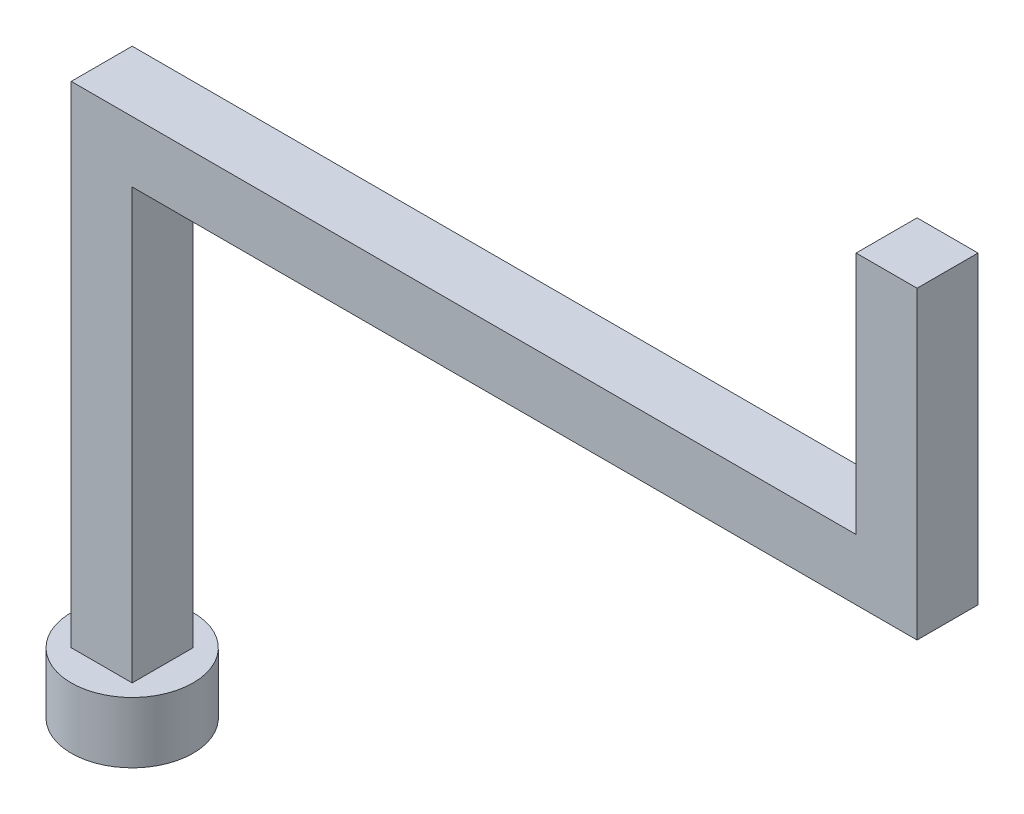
ISO-10303-21;
HEADER;
FILE_DESCRIPTION(('STEP AP214'),'2;1');
FILE_NAME('part.step','',(''),(''),'','','');
FILE_SCHEMA(('AUTOMOTIVE_DESIGN { 1 0 10303 214 1 1 1 1 }'));
ENDSEC;
DATA;
#1=APPLICATION_CONTEXT('core data for automotive mechanical design processes');
#2=APPLICATION_PROTOCOL_DEFINITION('international standard','automotive_design',2000,#1);
#3=PRODUCT_CONTEXT('',#1,'mechanical');
#4=PRODUCT('Part','Part','',(#3));
#5=PRODUCT_RELATED_PRODUCT_CATEGORY('part','',(#4));
#6=PRODUCT_DEFINITION_FORMATION('','',#4);
#7=PRODUCT_DEFINITION_CONTEXT('part definition',#1,'design');
#8=PRODUCT_DEFINITION('design','',#6,#7);
#9=PRODUCT_DEFINITION_SHAPE('','',#8);
#10=(LENGTH_UNIT() NAMED_UNIT(*) SI_UNIT(.MILLI.,.METRE.));
#11=(NAMED_UNIT(*) PLANE_ANGLE_UNIT() SI_UNIT($,.RADIAN.));
#12=(NAMED_UNIT(*) SI_UNIT($,.STERADIAN.) SOLID_ANGLE_UNIT());
#13=UNCERTAINTY_MEASURE_WITH_UNIT(LENGTH_MEASURE(1.E-05),#10,'distance_accuracy_value','');
#14=(GEOMETRIC_REPRESENTATION_CONTEXT(3) GLOBAL_UNCERTAINTY_ASSIGNED_CONTEXT((#13)) GLOBAL_UNIT_ASSIGNED_CONTEXT((#10,
#11,#12)) REPRESENTATION_CONTEXT('',''));
#15=CARTESIAN_POINT('',(0.,0.,0.));
#16=DIRECTION('',(0.,0.,1.));
#17=DIRECTION('',(1.,0.,0.));
#18=AXIS2_PLACEMENT_3D('',#15,#16,#17);
#19=CARTESIAN_POINT('',(0.,12.7,3.175));
#20=DIRECTION('',(-1.,0.,0.));
#21=DIRECTION('',(0.,0.,1.));
#22=AXIS2_PLACEMENT_3D('',#19,#20,#21);
#23=PLANE('',#22);
#24=DIRECTION('',(0.,1.,0.));
#25=VECTOR('',#24,1.);
#26=CARTESIAN_POINT('',(0.,12.7,0.));
#27=LINE('',#26,#25);
#28=CARTESIAN_POINT('',(0.,0.,0.));
#29=VERTEX_POINT('',#28);
#30=CARTESIAN_POINT('',(0.,22.377862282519,0.));
#31=VERTEX_POINT('',#30);
#32=EDGE_CURVE('E124',#29,#31,#27,.T.);
#33=ORIENTED_EDGE('',*,*,#32,.T.);
#34=DIRECTION('',(0.,0.,-1.));
#35=VECTOR('',#34,1.);
#36=CARTESIAN_POINT('',(0.,22.377862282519,3.175));
#37=LINE('',#36,#35);
#38=CARTESIAN_POINT('',(0.,22.377862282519,3.175));
#39=VERTEX_POINT('',#38);
#40=EDGE_CURVE('E11',#39,#31,#37,.T.);
#41=ORIENTED_EDGE('',*,*,#40,.F.);
#42=DIRECTION('',(0.,1.,0.));
#43=VECTOR('',#42,1.);
#44=CARTESIAN_POINT('',(0.,0.,3.175));
#45=LINE('',#44,#43);
#46=CARTESIAN_POINT('',(0.,0.,3.175));
#47=VERTEX_POINT('',#46);
#48=EDGE_CURVE('E85',#47,#39,#45,.T.);
#49=ORIENTED_EDGE('',*,*,#48,.F.);
#50=DIRECTION('',(0.,0.,-1.));
#51=VECTOR('',#50,1.);
#52=CARTESIAN_POINT('',(0.,0.,3.175));
#53=LINE('',#52,#51);
#54=EDGE_CURVE('E120',#47,#29,#53,.T.);
#55=ORIENTED_EDGE('',*,*,#54,.T.);
#56=EDGE_LOOP('',(#33,#41,#49,#55));
#57=FACE_BOUND('',#56,.T.);
#58=ADVANCED_FACE('F33',(#57),#23,.F.);
#59=CARTESIAN_POINT('',(40.8885604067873,22.377862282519,3.175));
#60=DIRECTION('',(0.,1.,0.));
#61=DIRECTION('',(-1.,0.,0.));
#62=AXIS2_PLACEMENT_3D('',#59,#60,#61);
#63=PLANE('',#62);
#64=DIRECTION('',(1.,0.,0.));
#65=VECTOR('',#64,1.);
#66=CARTESIAN_POINT('',(40.8885604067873,22.377862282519,0.));
#67=LINE('',#66,#65);
#68=CARTESIAN_POINT('',(40.8885604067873,22.377862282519,0.));
#69=VERTEX_POINT('',#68);
#70=EDGE_CURVE('E126',#31,#69,#67,.T.);
#71=ORIENTED_EDGE('',*,*,#70,.T.);
#72=DIRECTION('',(0.,0.,-1.));
#73=VECTOR('',#72,1.);
#74=CARTESIAN_POINT('',(40.8885604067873,22.377862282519,3.175));
#75=LINE('',#74,#73);
#76=CARTESIAN_POINT('',(40.8885604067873,22.377862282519,3.175));
#77=VERTEX_POINT('',#76);
#78=EDGE_CURVE('E41',#77,#69,#75,.T.);
#79=ORIENTED_EDGE('',*,*,#78,.F.);
#80=DIRECTION('',(1.,0.,0.));
#81=VECTOR('',#80,1.);
#82=CARTESIAN_POINT('',(40.8885604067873,22.377862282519,3.175));
#83=LINE('',#82,#81);
#84=EDGE_CURVE('E160',#39,#77,#83,.T.);
#85=ORIENTED_EDGE('',*,*,#84,.F.);
#86=ORIENTED_EDGE('',*,*,#40,.T.);
#87=EDGE_LOOP('',(#71,#79,#85,#86));
#88=FACE_BOUND('',#87,.T.);
#89=ADVANCED_FACE('F159',(#88),#63,.F.);
#90=CARTESIAN_POINT('',(40.8885604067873,38.252862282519,3.175));
#91=DIRECTION('',(-1.,0.,0.));
#92=DIRECTION('',(0.,0.,1.));
#93=AXIS2_PLACEMENT_3D('',#90,#91,#92);
#94=PLANE('',#93);
#95=DIRECTION('',(0.,1.,0.));
#96=VECTOR('',#95,1.);
#97=CARTESIAN_POINT('',(40.8885604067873,38.252862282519,0.));
#98=LINE('',#97,#96);
#99=CARTESIAN_POINT('',(40.8885604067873,38.252862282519,0.));
#100=VERTEX_POINT('',#99);
#101=EDGE_CURVE('E130',#69,#100,#98,.T.);
#102=ORIENTED_EDGE('',*,*,#101,.T.);
#103=DIRECTION('',(0.,0.,-1.));
#104=VECTOR('',#103,1.);
#105=CARTESIAN_POINT('',(40.8885604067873,38.252862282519,3.175));
#106=LINE('',#105,#104);
#107=CARTESIAN_POINT('',(40.8885604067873,38.252862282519,3.175));
#108=VERTEX_POINT('',#107);
#109=EDGE_CURVE('E148',#108,#100,#106,.T.);
#110=ORIENTED_EDGE('',*,*,#109,.F.);
#111=DIRECTION('',(0.,1.,0.));
#112=VECTOR('',#111,1.);
#113=CARTESIAN_POINT('',(40.8885604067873,25.552862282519,3.175));
#114=LINE('',#113,#112);
#115=EDGE_CURVE('E156',#77,#108,#114,.T.);
#116=ORIENTED_EDGE('',*,*,#115,.F.);
#117=ORIENTED_EDGE('',*,*,#78,.T.);
#118=EDGE_LOOP('',(#102,#110,#116,#117));
#119=FACE_BOUND('',#118,.T.);
#120=ADVANCED_FACE('F154',(#119),#94,.F.);
#121=CARTESIAN_POINT('',(37.7135604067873,38.252862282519,3.175));
#122=DIRECTION('',(0.,-1.,0.));
#123=DIRECTION('',(0.,0.,-1.));
#124=AXIS2_PLACEMENT_3D('',#121,#122,#123);
#125=PLANE('',#124);
#126=DIRECTION('',(-1.,0.,0.));
#127=VECTOR('',#126,1.);
#128=CARTESIAN_POINT('',(37.7135604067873,38.252862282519,0.));
#129=LINE('',#128,#127);
#130=CARTESIAN_POINT('',(37.7135604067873,38.252862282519,0.));
#131=VERTEX_POINT('',#130);
#132=EDGE_CURVE('E132',#100,#131,#129,.T.);
#133=ORIENTED_EDGE('',*,*,#132,.T.);
#134=DIRECTION('',(0.,0.,-1.));
#135=VECTOR('',#134,1.);
#136=CARTESIAN_POINT('',(37.7135604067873,38.252862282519,3.175));
#137=LINE('',#136,#135);
#138=CARTESIAN_POINT('',(37.7135604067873,38.252862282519,3.175));
#139=VERTEX_POINT('',#138);
#140=EDGE_CURVE('E145',#139,#131,#137,.T.);
#141=ORIENTED_EDGE('',*,*,#140,.F.);
#142=DIRECTION('',(-1.,0.,0.));
#143=VECTOR('',#142,1.);
#144=CARTESIAN_POINT('',(37.7135604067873,38.252862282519,3.175));
#145=LINE('',#144,#143);
#146=EDGE_CURVE('E172',#108,#139,#145,.T.);
#147=ORIENTED_EDGE('',*,*,#146,.F.);
#148=ORIENTED_EDGE('',*,*,#109,.T.);
#149=EDGE_LOOP('',(#133,#141,#147,#148));
#150=FACE_BOUND('',#149,.T.);
#151=ADVANCED_FACE('F168',(#150),#125,.F.);
#152=CARTESIAN_POINT('',(37.7135604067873,25.552862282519,3.175));
#153=DIRECTION('',(1.,0.,0.));
#154=DIRECTION('',(0.,0.,-1.));
#155=AXIS2_PLACEMENT_3D('',#152,#153,#154);
#156=PLANE('',#155);
#157=DIRECTION('',(0.,-1.,0.));
#158=VECTOR('',#157,1.);
#159=CARTESIAN_POINT('',(37.7135604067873,25.552862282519,0.));
#160=LINE('',#159,#158);
#161=CARTESIAN_POINT('',(37.7135604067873,25.552862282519,0.));
#162=VERTEX_POINT('',#161);
#163=EDGE_CURVE('E134',#131,#162,#160,.T.);
#164=ORIENTED_EDGE('',*,*,#163,.T.);
#165=DIRECTION('',(0.,0.,-1.));
#166=VECTOR('',#165,1.);
#167=CARTESIAN_POINT('',(37.7135604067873,25.552862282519,3.175));
#168=LINE('',#167,#166);
#169=CARTESIAN_POINT('',(37.7135604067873,25.552862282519,3.175));
#170=VERTEX_POINT('',#169);
#171=EDGE_CURVE('E114',#170,#162,#168,.T.);
#172=ORIENTED_EDGE('',*,*,#171,.F.);
#173=DIRECTION('',(0.,-1.,0.));
#174=VECTOR('',#173,1.);
#175=CARTESIAN_POINT('',(37.7135604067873,25.552862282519,3.175));
#176=LINE('',#175,#174);
#177=EDGE_CURVE('E106',#139,#170,#176,.T.);
#178=ORIENTED_EDGE('',*,*,#177,.F.);
#179=ORIENTED_EDGE('',*,*,#140,.T.);
#180=EDGE_LOOP('',(#164,#172,#178,#179));
#181=FACE_BOUND('',#180,.T.);
#182=ADVANCED_FACE('F171',(#181),#156,.F.);
#183=CARTESIAN_POINT('',(-3.175,25.552862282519,3.175));
#184=DIRECTION('',(0.,-1.,0.));
#185=DIRECTION('',(0.,0.,-1.));
#186=AXIS2_PLACEMENT_3D('',#183,#184,#185);
#187=PLANE('',#186);
#188=DIRECTION('',(-1.,0.,0.));
#189=VECTOR('',#188,1.);
#190=CARTESIAN_POINT('',(-3.175,25.552862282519,0.));
#191=LINE('',#190,#189);
#192=CARTESIAN_POINT('',(-3.175,25.552862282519,0.));
#193=VERTEX_POINT('',#192);
#194=EDGE_CURVE('E113',#162,#193,#191,.T.);
#195=ORIENTED_EDGE('',*,*,#194,.T.);
#196=DIRECTION('',(0.,0.,-1.));
#197=VECTOR('',#196,1.);
#198=CARTESIAN_POINT('',(-3.175,25.552862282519,3.175));
#199=LINE('',#198,#197);
#200=CARTESIAN_POINT('',(-3.175,25.552862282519,3.175));
#201=VERTEX_POINT('',#200);
#202=EDGE_CURVE('E111',#201,#193,#199,.T.);
#203=ORIENTED_EDGE('',*,*,#202,.F.);
#204=DIRECTION('',(-1.,0.,0.));
#205=VECTOR('',#204,1.);
#206=CARTESIAN_POINT('',(-3.175,25.552862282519,3.175));
#207=LINE('',#206,#205);
#208=EDGE_CURVE('E100',#170,#201,#207,.T.);
#209=ORIENTED_EDGE('',*,*,#208,.F.);
#210=ORIENTED_EDGE('',*,*,#171,.T.);
#211=EDGE_LOOP('',(#195,#203,#209,#210));
#212=FACE_BOUND('',#211,.T.);
#213=ADVANCED_FACE('F112',(#212),#187,.F.);
#214=CARTESIAN_POINT('',(-3.175,0.,3.175));
#215=DIRECTION('',(1.,0.,0.));
#216=DIRECTION('',(0.,0.,-1.));
#217=AXIS2_PLACEMENT_3D('',#214,#215,#216);
#218=PLANE('',#217);
#219=DIRECTION('',(0.,-1.,0.));
#220=VECTOR('',#219,1.);
#221=CARTESIAN_POINT('',(-3.175,0.,0.));
#222=LINE('',#221,#220);
#223=CARTESIAN_POINT('',(-3.175,0.,0.));
#224=VERTEX_POINT('',#223);
#225=EDGE_CURVE('E76',#193,#224,#222,.T.);
#226=ORIENTED_EDGE('',*,*,#225,.T.);
#227=DIRECTION('',(0.,0.,-1.));
#228=VECTOR('',#227,1.);
#229=CARTESIAN_POINT('',(-3.175,0.,3.175));
#230=LINE('',#229,#228);
#231=CARTESIAN_POINT('',(-3.175,0.,3.175));
#232=VERTEX_POINT('',#231);
#233=EDGE_CURVE('E115',#232,#224,#230,.T.);
#234=ORIENTED_EDGE('',*,*,#233,.F.);
#235=DIRECTION('',(0.,-1.,0.));
#236=VECTOR('',#235,1.);
#237=CARTESIAN_POINT('',(-3.175,15.875,3.175));
#238=LINE('',#237,#236);
#239=EDGE_CURVE('E104',#201,#232,#238,.T.);
#240=ORIENTED_EDGE('',*,*,#239,.F.);
#241=ORIENTED_EDGE('',*,*,#202,.T.);
#242=EDGE_LOOP('',(#226,#234,#240,#241));
#243=FACE_BOUND('',#242,.T.);
#244=ADVANCED_FACE('F117',(#243),#218,.F.);
#245=CARTESIAN_POINT('',(0.,22.377862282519,3.175));
#246=DIRECTION('',(0.,0.,1.));
#247=DIRECTION('',(1.,0.,0.));
#248=AXIS2_PLACEMENT_3D('',#245,#246,#247);
#249=PLANE('',#248);
#250=ORIENTED_EDGE('',*,*,#48,.T.);
#251=ORIENTED_EDGE('',*,*,#84,.T.);
#252=ORIENTED_EDGE('',*,*,#115,.T.);
#253=ORIENTED_EDGE('',*,*,#146,.T.);
#254=ORIENTED_EDGE('',*,*,#177,.T.);
#255=ORIENTED_EDGE('',*,*,#208,.T.);
#256=ORIENTED_EDGE('',*,*,#239,.T.);
#257=DIRECTION('',(1.,0.,0.));
#258=VECTOR('',#257,1.);
#259=CARTESIAN_POINT('',(0.,0.,3.175));
#260=LINE('',#259,#258);
#261=EDGE_CURVE('E49',#232,#47,#260,.T.);
#262=ORIENTED_EDGE('',*,*,#261,.T.);
#263=EDGE_LOOP('',(#250,#251,#252,#253,#254,#255,#256,#262));
#264=FACE_BOUND('',#263,.T.);
#265=ADVANCED_FACE('F102',(#264),#249,.T.);
#266=CARTESIAN_POINT('',(0.,22.377862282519,0.));
#267=DIRECTION('',(0.,0.,1.));
#268=DIRECTION('',(1.,0.,0.));
#269=AXIS2_PLACEMENT_3D('',#266,#267,#268);
#270=PLANE('',#269);
#271=ORIENTED_EDGE('',*,*,#32,.F.);
#272=DIRECTION('',(1.,0.,0.));
#273=VECTOR('',#272,1.);
#274=CARTESIAN_POINT('',(0.,0.,0.));
#275=LINE('',#274,#273);
#276=EDGE_CURVE('E138',#224,#29,#275,.T.);
#277=ORIENTED_EDGE('',*,*,#276,.F.);
#278=ORIENTED_EDGE('',*,*,#225,.F.);
#279=ORIENTED_EDGE('',*,*,#194,.F.);
#280=ORIENTED_EDGE('',*,*,#163,.F.);
#281=ORIENTED_EDGE('',*,*,#132,.F.);
#282=ORIENTED_EDGE('',*,*,#101,.F.);
#283=ORIENTED_EDGE('',*,*,#70,.F.);
#284=EDGE_LOOP('',(#271,#277,#278,#279,#280,#281,#282,#283));
#285=FACE_BOUND('',#284,.T.);
#286=ADVANCED_FACE('F163',(#285),#270,.F.);
#287=CARTESIAN_POINT('',(-1.5875,-3.175,1.5875));
#288=DIRECTION('',(0.,1.,0.));
#289=DIRECTION('',(-1.,0.,0.));
#290=AXIS2_PLACEMENT_3D('',#287,#288,#289);
#291=CYLINDRICAL_SURFACE('',#290,3.175);
#292=CARTESIAN_POINT('',(-1.5875,-3.175,1.5875));
#293=DIRECTION('',(0.,-1.,0.));
#294=DIRECTION('',(1.,0.,0.));
#295=AXIS2_PLACEMENT_3D('',#292,#293,#294);
#296=CIRCLE('',#295,3.175);
#297=CARTESIAN_POINT('',(1.5875,-3.175,1.5875));
#298=VERTEX_POINT('',#297);
#299=EDGE_CURVE('E127',#298,#298,#296,.T.);
#300=ORIENTED_EDGE('',*,*,#299,.F.);
#301=EDGE_LOOP('',(#300));
#302=FACE_BOUND('',#301,.T.);
#303=CARTESIAN_POINT('',(-1.5875,0.,1.5875));
#304=DIRECTION('',(0.,-1.,0.));
#305=DIRECTION('',(1.,0.,0.));
#306=AXIS2_PLACEMENT_3D('',#303,#304,#305);
#307=CIRCLE('',#306,3.175);
#308=CARTESIAN_POINT('',(1.5875,0.,1.5875));
#309=VERTEX_POINT('',#308);
#310=EDGE_CURVE('E178',#309,#309,#307,.T.);
#311=ORIENTED_EDGE('',*,*,#310,.T.);
#312=EDGE_LOOP('',(#311));
#313=FACE_BOUND('',#312,.T.);
#314=ADVANCED_FACE('F186',(#302,#313),#291,.T.);
#315=CARTESIAN_POINT('',(-1.5875,-3.175,1.5875));
#316=DIRECTION('',(0.,-1.,0.));
#317=DIRECTION('',(1.,0.,0.));
#318=AXIS2_PLACEMENT_3D('',#315,#316,#317);
#319=PLANE('',#318);
#320=ORIENTED_EDGE('',*,*,#299,.T.);
#321=EDGE_LOOP('',(#320));
#322=FACE_BOUND('',#321,.T.);
#323=ADVANCED_FACE('F184',(#322),#319,.T.);
#324=CARTESIAN_POINT('',(-1.5875,0.,1.5875));
#325=DIRECTION('',(0.,-1.,0.));
#326=DIRECTION('',(1.,0.,0.));
#327=AXIS2_PLACEMENT_3D('',#324,#325,#326);
#328=PLANE('',#327);
#329=ORIENTED_EDGE('',*,*,#261,.F.);
#330=ORIENTED_EDGE('',*,*,#233,.T.);
#331=ORIENTED_EDGE('',*,*,#276,.T.);
#332=ORIENTED_EDGE('',*,*,#54,.F.);
#333=EDGE_LOOP('',(#329,#330,#331,#332));
#334=FACE_BOUND('',#333,.T.);
#335=ORIENTED_EDGE('',*,*,#310,.F.);
#336=EDGE_LOOP('',(#335));
#337=FACE_BOUND('',#336,.T.);
#338=ADVANCED_FACE('F192',(#334,#337),#328,.F.);
#339=CLOSED_SHELL('',(#58,#89,#120,#151,#182,#213,#244,#265,#286,#314,#323,#338));
#340=MANIFOLD_SOLID_BREP('B2',#339);
#341=ADVANCED_BREP_SHAPE_REPRESENTATION('',(#18,#340),#14);
#342=SHAPE_DEFINITION_REPRESENTATION(#9,#341);
ENDSEC;
END-ISO-10303-21;
